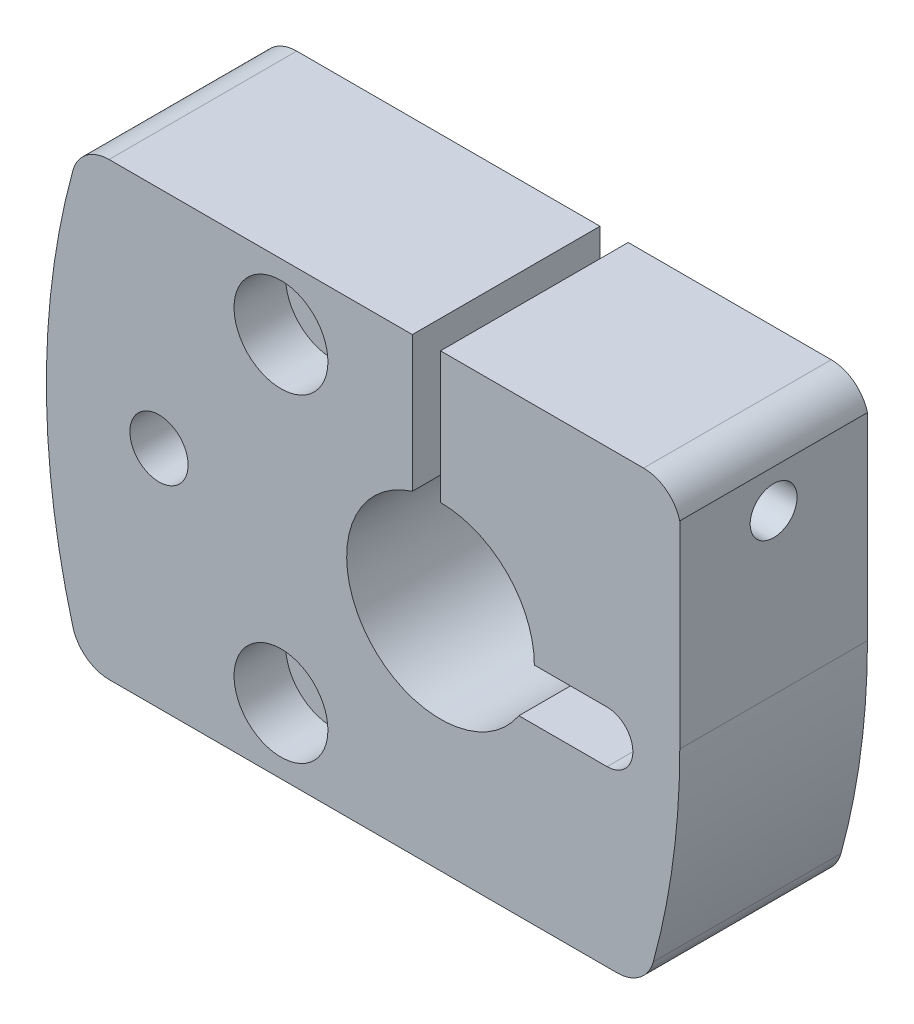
ISO-10303-21;
HEADER;
FILE_DESCRIPTION(('STEP AP214'),'2;1');
FILE_NAME('part.step','',(''),(''),'','','');
FILE_SCHEMA(('AUTOMOTIVE_DESIGN { 1 0 10303 214 1 1 1 1 }'));
ENDSEC;
DATA;
#1=APPLICATION_CONTEXT('core data for automotive mechanical design processes');
#2=APPLICATION_PROTOCOL_DEFINITION('international standard','automotive_design',2000,#1);
#3=PRODUCT_CONTEXT('',#1,'mechanical');
#4=PRODUCT('Part','Part','',(#3));
#5=PRODUCT_RELATED_PRODUCT_CATEGORY('part','',(#4));
#6=PRODUCT_DEFINITION_FORMATION('','',#4);
#7=PRODUCT_DEFINITION_CONTEXT('part definition',#1,'design');
#8=PRODUCT_DEFINITION('design','',#6,#7);
#9=PRODUCT_DEFINITION_SHAPE('','',#8);
#10=(LENGTH_UNIT() NAMED_UNIT(*) SI_UNIT(.MILLI.,.METRE.));
#11=(NAMED_UNIT(*) PLANE_ANGLE_UNIT() SI_UNIT($,.RADIAN.));
#12=(NAMED_UNIT(*) SI_UNIT($,.STERADIAN.) SOLID_ANGLE_UNIT());
#13=UNCERTAINTY_MEASURE_WITH_UNIT(LENGTH_MEASURE(1.E-05),#10,'distance_accuracy_value','');
#14=(GEOMETRIC_REPRESENTATION_CONTEXT(3) GLOBAL_UNCERTAINTY_ASSIGNED_CONTEXT((#13)) GLOBAL_UNIT_ASSIGNED_CONTEXT((#10,
#11,#12)) REPRESENTATION_CONTEXT('',''));
#15=CARTESIAN_POINT('',(0.,0.,0.));
#16=DIRECTION('',(0.,0.,1.));
#17=DIRECTION('',(1.,0.,0.));
#18=AXIS2_PLACEMENT_3D('',#15,#16,#17);
#19=CARTESIAN_POINT('',(-17.0000000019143,16.9999999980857,14.5));
#20=DIRECTION('',(0.,0.,-1.));
#21=DIRECTION('',(1.12604754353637E-10,-1.,0.));
#22=AXIS2_PLACEMENT_3D('',#19,#20,#21);
#23=CYLINDRICAL_SURFACE('',#22,2.75);
#24=CARTESIAN_POINT('',(-17.0000000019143,16.9999999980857,14.5));
#25=DIRECTION('',(0.,0.,-1.));
#26=DIRECTION('',(1.12604754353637E-10,-1.,0.));
#27=AXIS2_PLACEMENT_3D('',#24,#25,#26);
#28=CIRCLE('',#27,2.75);
#29=CARTESIAN_POINT('',(-17.0000000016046,14.2499999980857,14.5));
#30=VERTEX_POINT('',#29);
#31=EDGE_CURVE('E186',#30,#30,#28,.T.);
#32=ORIENTED_EDGE('',*,*,#31,.F.);
#33=EDGE_LOOP('',(#32));
#34=FACE_BOUND('',#33,.T.);
#35=CARTESIAN_POINT('',(-17.0000000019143,16.9999999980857,5.5));
#36=DIRECTION('',(0.,0.,-1.));
#37=DIRECTION('',(1.12604754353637E-10,-1.,0.));
#38=AXIS2_PLACEMENT_3D('',#35,#36,#37);
#39=CIRCLE('',#38,2.75);
#40=CARTESIAN_POINT('',(-17.0000000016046,14.2499999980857,5.5));
#41=VERTEX_POINT('',#40);
#42=EDGE_CURVE('E188',#41,#41,#39,.F.);
#43=ORIENTED_EDGE('',*,*,#42,.F.);
#44=EDGE_LOOP('',(#43));
#45=FACE_BOUND('',#44,.T.);
#46=ADVANCED_FACE('F14',(#34,#45),#23,.F.);
#47=CARTESIAN_POINT('',(-16.9999999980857,-17.0000000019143,14.5));
#48=DIRECTION('',(0.,0.,-1.));
#49=DIRECTION('',(1.12604754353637E-10,-1.,0.));
#50=AXIS2_PLACEMENT_3D('',#47,#48,#49);
#51=CYLINDRICAL_SURFACE('',#50,2.75);
#52=CARTESIAN_POINT('',(-16.9999999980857,-17.0000000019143,14.5));
#53=DIRECTION('',(0.,0.,-1.));
#54=DIRECTION('',(1.12604754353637E-10,-1.,0.));
#55=AXIS2_PLACEMENT_3D('',#52,#53,#54);
#56=CIRCLE('',#55,2.75);
#57=CARTESIAN_POINT('',(-16.999999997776,-19.7500000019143,14.5));
#58=VERTEX_POINT('',#57);
#59=EDGE_CURVE('E183',#58,#58,#56,.T.);
#60=ORIENTED_EDGE('',*,*,#59,.F.);
#61=EDGE_LOOP('',(#60));
#62=FACE_BOUND('',#61,.T.);
#63=CARTESIAN_POINT('',(-16.9999999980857,-17.0000000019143,5.5));
#64=DIRECTION('',(0.,0.,-1.));
#65=DIRECTION('',(1.12604754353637E-10,-1.,0.));
#66=AXIS2_PLACEMENT_3D('',#63,#64,#65);
#67=CIRCLE('',#66,2.75);
#68=CARTESIAN_POINT('',(-16.999999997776,-19.7500000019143,5.5));
#69=VERTEX_POINT('',#68);
#70=EDGE_CURVE('E18',#69,#69,#67,.F.);
#71=ORIENTED_EDGE('',*,*,#70,.F.);
#72=EDGE_LOOP('',(#71));
#73=FACE_BOUND('',#72,.T.);
#74=ADVANCED_FACE('F198',(#62,#73),#51,.F.);
#75=CARTESIAN_POINT('',(-9.50000000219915,19.5299999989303,7.461294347));
#76=DIRECTION('',(-1.,-1.12604754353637E-10,0.));
#77=DIRECTION('',(1.12604754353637E-10,-1.,0.));
#78=AXIS2_PLACEMENT_3D('',#75,#76,#77);
#79=PLANE('',#78);
#80=CARTESIAN_POINT('',(-9.50000000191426,16.9999999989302,10.));
#81=DIRECTION('',(1.,1.12604754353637E-10,0.));
#82=DIRECTION('',(0.,0.,-1.));
#83=AXIS2_PLACEMENT_3D('',#80,#81,#82);
#84=CIRCLE('',#83,2.5);
#85=CARTESIAN_POINT('',(-9.50000000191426,16.9999999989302,7.5));
#86=VERTEX_POINT('',#85);
#87=EDGE_CURVE('E180',#86,#86,#84,.T.);
#88=ORIENTED_EDGE('',*,*,#87,.T.);
#89=EDGE_LOOP('',(#88));
#90=FACE_BOUND('',#89,.T.);
#91=ADVANCED_FACE('F200',(#90),#79,.F.);
#92=CARTESIAN_POINT('',(-11.9225886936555,-11.9400000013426,5.5));
#93=DIRECTION('',(0.,0.,-1.));
#94=DIRECTION('',(1.12604754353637E-10,-1.,0.));
#95=AXIS2_PLACEMENT_3D('',#92,#93,#94);
#96=PLANE('',#95);
#97=ORIENTED_EDGE('',*,*,#70,.T.);
#98=EDGE_LOOP('',(#97));
#99=FACE_BOUND('',#98,.T.);
#100=CARTESIAN_POINT('',(-16.9999999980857,-17.0000000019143,5.5));
#101=DIRECTION('',(0.,0.,-1.));
#102=DIRECTION('',(1.12604754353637E-10,-1.,0.));
#103=AXIS2_PLACEMENT_3D('',#100,#101,#102);
#104=CIRCLE('',#103,5.);
#105=CARTESIAN_POINT('',(-16.9999999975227,-22.0000000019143,5.5));
#106=VERTEX_POINT('',#105);
#107=EDGE_CURVE('E177',#106,#106,#104,.T.);
#108=ORIENTED_EDGE('',*,*,#107,.T.);
#109=EDGE_LOOP('',(#108));
#110=FACE_BOUND('',#109,.T.);
#111=ADVANCED_FACE('F195',(#99,#110),#96,.T.);
#112=CARTESIAN_POINT('',(-11.922588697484,22.0599999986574,5.5));
#113=DIRECTION('',(0.,0.,-1.));
#114=DIRECTION('',(1.12604754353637E-10,-1.,0.));
#115=AXIS2_PLACEMENT_3D('',#112,#113,#114);
#116=PLANE('',#115);
#117=ORIENTED_EDGE('',*,*,#42,.T.);
#118=EDGE_LOOP('',(#117));
#119=FACE_BOUND('',#118,.T.);
#120=CARTESIAN_POINT('',(-17.0000000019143,16.9999999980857,5.5));
#121=DIRECTION('',(0.,0.,-1.));
#122=DIRECTION('',(1.12604754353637E-10,-1.,0.));
#123=AXIS2_PLACEMENT_3D('',#120,#121,#122);
#124=CIRCLE('',#123,5.);
#125=CARTESIAN_POINT('',(-17.0000000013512,11.9999999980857,5.5));
#126=VERTEX_POINT('',#125);
#127=EDGE_CURVE('E174',#126,#126,#124,.T.);
#128=ORIENTED_EDGE('',*,*,#127,.T.);
#129=EDGE_LOOP('',(#128));
#130=FACE_BOUND('',#129,.T.);
#131=ADVANCED_FACE('F230',(#119,#130),#116,.T.);
#132=CARTESIAN_POINT('',(-1.91425000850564E-09,17.,10.));
#133=DIRECTION('',(1.,1.12604754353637E-10,0.));
#134=DIRECTION('',(0.,0.,-1.));
#135=AXIS2_PLACEMENT_3D('',#132,#133,#134);
#136=CYLINDRICAL_SURFACE('',#135,2.5);
#137=CARTESIAN_POINT('',(25.4999999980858,17.0000000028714,10.));
#138=DIRECTION('',(1.,1.12604754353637E-10,0.));
#139=DIRECTION('',(0.,0.,-1.));
#140=AXIS2_PLACEMENT_3D('',#137,#138,#139);
#141=CIRCLE('',#140,2.5);
#142=CARTESIAN_POINT('',(25.4999999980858,17.0000000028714,7.5));
#143=VERTEX_POINT('',#142);
#144=EDGE_CURVE('E166',#143,#143,#141,.T.);
#145=ORIENTED_EDGE('',*,*,#144,.T.);
#146=EDGE_LOOP('',(#145));
#147=FACE_BOUND('',#146,.T.);
#148=CARTESIAN_POINT('',(-1.91425000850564E-09,17.,10.));
#149=DIRECTION('',(1.,1.12604754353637E-10,0.));
#150=DIRECTION('',(0.,0.,-1.));
#151=AXIS2_PLACEMENT_3D('',#148,#149,#150);
#152=CIRCLE('',#151,2.5);
#153=CARTESIAN_POINT('',(-1.91425000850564E-09,17.,7.5));
#154=VERTEX_POINT('',#153);
#155=EDGE_CURVE('E171',#154,#154,#152,.F.);
#156=ORIENTED_EDGE('',*,*,#155,.T.);
#157=EDGE_LOOP('',(#156));
#158=FACE_BOUND('',#157,.T.);
#159=ADVANCED_FACE('F233',(#147,#158),#136,.F.);
#160=CARTESIAN_POINT('',(-11.9225886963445,11.9399999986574,14.5));
#161=DIRECTION('',(0.,0.,1.));
#162=DIRECTION('',(-1.12604754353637E-10,1.,0.));
#163=AXIS2_PLACEMENT_3D('',#160,#161,#162);
#164=PLANE('',#163);
#165=ORIENTED_EDGE('',*,*,#31,.T.);
#166=EDGE_LOOP('',(#165));
#167=FACE_BOUND('',#166,.T.);
#168=CARTESIAN_POINT('',(-17.0000000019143,16.9999999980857,14.5));
#169=DIRECTION('',(0.,0.,1.));
#170=DIRECTION('',(-1.12604754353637E-10,1.,0.));
#171=AXIS2_PLACEMENT_3D('',#168,#169,#170);
#172=CIRCLE('',#171,5.);
#173=CARTESIAN_POINT('',(-17.0000000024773,21.9999999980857,14.5));
#174=VERTEX_POINT('',#173);
#175=EDGE_CURVE('E162',#174,#174,#172,.T.);
#176=ORIENTED_EDGE('',*,*,#175,.T.);
#177=EDGE_LOOP('',(#176));
#178=FACE_BOUND('',#177,.T.);
#179=ADVANCED_FACE('F234',(#167,#178),#164,.T.);
#180=CARTESIAN_POINT('',(-11.9225886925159,-22.0600000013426,14.5));
#181=DIRECTION('',(0.,0.,1.));
#182=DIRECTION('',(-1.12604754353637E-10,1.,0.));
#183=AXIS2_PLACEMENT_3D('',#180,#181,#182);
#184=PLANE('',#183);
#185=ORIENTED_EDGE('',*,*,#59,.T.);
#186=EDGE_LOOP('',(#185));
#187=FACE_BOUND('',#186,.T.);
#188=CARTESIAN_POINT('',(-16.9999999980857,-17.0000000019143,14.5));
#189=DIRECTION('',(0.,0.,1.));
#190=DIRECTION('',(-1.12604754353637E-10,1.,0.));
#191=AXIS2_PLACEMENT_3D('',#188,#189,#190);
#192=CIRCLE('',#191,5.);
#193=CARTESIAN_POINT('',(-16.9999999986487,-12.0000000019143,14.5));
#194=VERTEX_POINT('',#193);
#195=EDGE_CURVE('E159',#194,#194,#192,.T.);
#196=ORIENTED_EDGE('',*,*,#195,.T.);
#197=EDGE_LOOP('',(#196));
#198=FACE_BOUND('',#197,.T.);
#199=ADVANCED_FACE('F237',(#187,#198),#184,.T.);
#200=CARTESIAN_POINT('',(-9.50000000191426,16.9999999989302,10.));
#201=DIRECTION('',(1.,1.12604754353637E-10,0.));
#202=DIRECTION('',(0.,0.,-1.));
#203=AXIS2_PLACEMENT_3D('',#200,#201,#202);
#204=CYLINDRICAL_SURFACE('',#203,2.5);
#205=ORIENTED_EDGE('',*,*,#87,.F.);
#206=EDGE_LOOP('',(#205));
#207=FACE_BOUND('',#206,.T.);
#208=CARTESIAN_POINT('',(-3.00000000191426,16.9999999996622,10.));
#209=DIRECTION('',(1.,1.12604754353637E-10,0.));
#210=DIRECTION('',(0.,0.,-1.));
#211=AXIS2_PLACEMENT_3D('',#208,#209,#210);
#212=CIRCLE('',#211,2.5);
#213=CARTESIAN_POINT('',(-3.00000000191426,16.9999999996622,7.5));
#214=VERTEX_POINT('',#213);
#215=EDGE_CURVE('E151',#214,#214,#212,.T.);
#216=ORIENTED_EDGE('',*,*,#215,.T.);
#217=EDGE_LOOP('',(#216));
#218=FACE_BOUND('',#217,.T.);
#219=ADVANCED_FACE('F241',(#207,#218),#204,.F.);
#220=CARTESIAN_POINT('',(-16.9999999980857,-17.0000000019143,5.5));
#221=DIRECTION('',(0.,0.,-1.));
#222=DIRECTION('',(1.12604754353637E-10,-1.,0.));
#223=AXIS2_PLACEMENT_3D('',#220,#221,#222);
#224=CYLINDRICAL_SURFACE('',#223,5.);
#225=ORIENTED_EDGE('',*,*,#107,.F.);
#226=EDGE_LOOP('',(#225));
#227=FACE_BOUND('',#226,.T.);
#228=CARTESIAN_POINT('',(-16.9999999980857,-17.0000000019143,0.));
#229=DIRECTION('',(0.,0.,-1.));
#230=DIRECTION('',(1.12604754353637E-10,-1.,0.));
#231=AXIS2_PLACEMENT_3D('',#228,#229,#230);
#232=CIRCLE('',#231,5.);
#233=CARTESIAN_POINT('',(-16.9999999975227,-22.0000000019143,0.));
#234=VERTEX_POINT('',#233);
#235=EDGE_CURVE('E295',#234,#234,#232,.T.);
#236=ORIENTED_EDGE('',*,*,#235,.T.);
#237=EDGE_LOOP('',(#236));
#238=FACE_BOUND('',#237,.T.);
#239=ADVANCED_FACE('F661',(#227,#238),#224,.F.);
#240=CARTESIAN_POINT('',(-17.0000000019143,16.9999999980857,5.5));
#241=DIRECTION('',(0.,0.,-1.));
#242=DIRECTION('',(1.12604754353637E-10,-1.,0.));
#243=AXIS2_PLACEMENT_3D('',#240,#241,#242);
#244=CYLINDRICAL_SURFACE('',#243,5.);
#245=ORIENTED_EDGE('',*,*,#127,.F.);
#246=EDGE_LOOP('',(#245));
#247=FACE_BOUND('',#246,.T.);
#248=CARTESIAN_POINT('',(-17.0000000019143,16.9999999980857,0.));
#249=DIRECTION('',(0.,0.,-1.));
#250=DIRECTION('',(1.12604754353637E-10,-1.,0.));
#251=AXIS2_PLACEMENT_3D('',#248,#249,#250);
#252=CIRCLE('',#251,5.);
#253=CARTESIAN_POINT('',(-17.0000000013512,11.9999999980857,0.));
#254=VERTEX_POINT('',#253);
#255=EDGE_CURVE('E292',#254,#254,#252,.T.);
#256=ORIENTED_EDGE('',*,*,#255,.T.);
#257=EDGE_LOOP('',(#256));
#258=FACE_BOUND('',#257,.T.);
#259=ADVANCED_FACE('F246',(#247,#258),#244,.F.);
#260=CARTESIAN_POINT('',(-1.12604717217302E-09,10.,20.));
#261=DIRECTION('',(1.,1.12604754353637E-10,0.));
#262=DIRECTION('',(0.,0.,-1.));
#263=AXIS2_PLACEMENT_3D('',#260,#261,#262);
#264=PLANE('',#263);
#265=ORIENTED_EDGE('',*,*,#155,.F.);
#266=EDGE_LOOP('',(#265));
#267=FACE_BOUND('',#266,.T.);
#268=DIRECTION('',(0.,0.,1.));
#269=VECTOR('',#268,1.);
#270=CARTESIAN_POINT('',(2.97600138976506E-09,10.,10.));
#271=LINE('',#270,#269);
#272=CARTESIAN_POINT('',(7.71755229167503E-09,10.,0.));
#273=VERTEX_POINT('',#272);
#274=CARTESIAN_POINT('',(7.71755229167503E-09,10.,20.));
#275=VERTEX_POINT('',#274);
#276=EDGE_CURVE('E125',#273,#275,#271,.T.);
#277=ORIENTED_EDGE('',*,*,#276,.T.);
#278=DIRECTION('',(1.12604754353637E-10,-1.,0.));
#279=VECTOR('',#278,1.);
#280=CARTESIAN_POINT('',(1.3585150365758E-08,0.,20.));
#281=LINE('',#280,#279);
#282=CARTESIAN_POINT('',(6.35425045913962E-09,24.,20.));
#283=VERTEX_POINT('',#282);
#284=EDGE_CURVE('E371',#283,#275,#281,.T.);
#285=ORIENTED_EDGE('',*,*,#284,.F.);
#286=DIRECTION('',(0.,0.,-1.));
#287=VECTOR('',#286,1.);
#288=CARTESIAN_POINT('',(-2.70249794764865E-09,24.,10.));
#289=LINE('',#288,#287);
#290=CARTESIAN_POINT('',(6.35425045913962E-09,24.,0.));
#291=VERTEX_POINT('',#290);
#292=EDGE_CURVE('E165',#283,#291,#289,.T.);
#293=ORIENTED_EDGE('',*,*,#292,.T.);
#294=DIRECTION('',(1.12604754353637E-10,-1.,0.));
#295=VECTOR('',#294,1.);
#296=CARTESIAN_POINT('',(1.3585150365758E-08,0.,0.));
#297=LINE('',#296,#295);
#298=EDGE_CURVE('E297',#291,#273,#297,.T.);
#299=ORIENTED_EDGE('',*,*,#298,.T.);
#300=EDGE_LOOP('',(#277,#285,#293,#299));
#301=FACE_BOUND('',#300,.T.);
#302=ADVANCED_FACE('F243',(#267,#301),#264,.F.);
#303=CARTESIAN_POINT('',(0.,0.,20.));
#304=DIRECTION('',(0.,0.,-1.));
#305=DIRECTION('',(1.12604754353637E-10,-1.,0.));
#306=AXIS2_PLACEMENT_3D('',#303,#304,#305);
#307=CYLINDRICAL_SURFACE('',#306,10.);
#308=DIRECTION('',(0.,0.,1.));
#309=VECTOR('',#308,1.);
#310=CARTESIAN_POINT('',(10.,1.12605064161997E-09,10.));
#311=LINE('',#310,#309);
#312=CARTESIAN_POINT('',(10.,1.12605064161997E-09,0.));
#313=VERTEX_POINT('',#312);
#314=CARTESIAN_POINT('',(10.,1.12605064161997E-09,20.));
#315=VERTEX_POINT('',#314);
#316=EDGE_CURVE('E132',#313,#315,#311,.T.);
#317=ORIENTED_EDGE('',*,*,#316,.T.);
#318=CARTESIAN_POINT('',(0.,0.,20.));
#319=DIRECTION('',(0.,0.,-1.));
#320=DIRECTION('',(1.12604754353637E-10,-1.,0.));
#321=AXIS2_PLACEMENT_3D('',#318,#319,#320);
#322=CIRCLE('',#321,10.);
#323=EDGE_CURVE('E370',#275,#315,#322,.T.);
#324=ORIENTED_EDGE('',*,*,#323,.F.);
#325=ORIENTED_EDGE('',*,*,#276,.F.);
#326=CARTESIAN_POINT('',(0.,0.,0.));
#327=DIRECTION('',(0.,0.,-1.));
#328=DIRECTION('',(1.12604754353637E-10,-1.,0.));
#329=AXIS2_PLACEMENT_3D('',#326,#327,#328);
#330=CIRCLE('',#329,10.);
#331=EDGE_CURVE('E144',#273,#313,#330,.T.);
#332=ORIENTED_EDGE('',*,*,#331,.T.);
#333=EDGE_LOOP('',(#317,#324,#325,#332));
#334=FACE_BOUND('',#333,.T.);
#335=ADVANCED_FACE('F150',(#334),#307,.F.);
#336=CARTESIAN_POINT('',(17.75,1.99869981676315E-09,20.));
#337=DIRECTION('',(-1.12604754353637E-10,1.,0.));
#338=DIRECTION('',(0.,0.,-1.));
#339=AXIS2_PLACEMENT_3D('',#336,#337,#338);
#340=PLANE('',#339);
#341=DIRECTION('',(0.,0.,1.));
#342=VECTOR('',#341,1.);
#343=CARTESIAN_POINT('',(17.750000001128,1.99869981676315E-09,10.));
#344=LINE('',#343,#342);
#345=CARTESIAN_POINT('',(17.750000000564,1.99869981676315E-09,0.));
#346=VERTEX_POINT('',#345);
#347=CARTESIAN_POINT('',(17.750000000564,1.99869981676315E-09,20.));
#348=VERTEX_POINT('',#347);
#349=EDGE_CURVE('E138',#346,#348,#344,.T.);
#350=ORIENTED_EDGE('',*,*,#349,.T.);
#351=DIRECTION('',(1.,1.12604754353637E-10,0.));
#352=VECTOR('',#351,1.);
#353=CARTESIAN_POINT('',(-8.80382733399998,-9.9134936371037E-10,20.));
#354=LINE('',#353,#352);
#355=EDGE_CURVE('E137',#315,#348,#354,.T.);
#356=ORIENTED_EDGE('',*,*,#355,.F.);
#357=ORIENTED_EDGE('',*,*,#316,.F.);
#358=DIRECTION('',(1.,1.12604754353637E-10,0.));
#359=VECTOR('',#358,1.);
#360=CARTESIAN_POINT('',(-8.80382733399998,-9.9134936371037E-10,0.));
#361=LINE('',#360,#359);
#362=EDGE_CURVE('E136',#313,#346,#361,.T.);
#363=ORIENTED_EDGE('',*,*,#362,.T.);
#364=EDGE_LOOP('',(#350,#356,#357,#363));
#365=FACE_BOUND('',#364,.T.);
#366=ADVANCED_FACE('F135',(#365),#340,.F.);
#367=CARTESIAN_POINT('',(17.7500000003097,-2.74999999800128,20.));
#368=DIRECTION('',(0.,0.,-1.));
#369=DIRECTION('',(1.12604754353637E-10,-1.,0.));
#370=AXIS2_PLACEMENT_3D('',#367,#368,#369);
#371=CYLINDRICAL_SURFACE('',#370,2.75);
#372=DIRECTION('',(0.,0.,1.));
#373=VECTOR('',#372,1.);
#374=CARTESIAN_POINT('',(17.7500000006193,-5.49999999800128,10.));
#375=LINE('',#374,#373);
#376=CARTESIAN_POINT('',(17.7500000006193,-5.49999999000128,0.));
#377=VERTEX_POINT('',#376);
#378=CARTESIAN_POINT('',(17.7500000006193,-5.49999999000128,20.));
#379=VERTEX_POINT('',#378);
#380=EDGE_CURVE('E403',#377,#379,#375,.T.);
#381=ORIENTED_EDGE('',*,*,#380,.T.);
#382=CARTESIAN_POINT('',(17.7500000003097,-2.74999999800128,20.));
#383=DIRECTION('',(0.,0.,-1.));
#384=DIRECTION('',(1.12604754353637E-10,-1.,0.));
#385=AXIS2_PLACEMENT_3D('',#382,#383,#384);
#386=CIRCLE('',#385,2.75);
#387=EDGE_CURVE('E368',#348,#379,#386,.T.);
#388=ORIENTED_EDGE('',*,*,#387,.F.);
#389=ORIENTED_EDGE('',*,*,#349,.F.);
#390=CARTESIAN_POINT('',(17.7500000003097,-2.74999999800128,0.));
#391=DIRECTION('',(0.,0.,-1.));
#392=DIRECTION('',(1.12604754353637E-10,-1.,0.));
#393=AXIS2_PLACEMENT_3D('',#390,#391,#392);
#394=CIRCLE('',#393,2.75);
#395=EDGE_CURVE('E148',#346,#377,#394,.T.);
#396=ORIENTED_EDGE('',*,*,#395,.T.);
#397=EDGE_LOOP('',(#381,#388,#389,#396));
#398=FACE_BOUND('',#397,.T.);
#399=ADVANCED_FACE('F250',(#398),#371,.F.);
#400=CARTESIAN_POINT('',(17.7500000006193,-5.49999999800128,0.));
#401=DIRECTION('',(1.12604754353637E-10,-1.,0.));
#402=DIRECTION('',(0.,0.,1.));
#403=AXIS2_PLACEMENT_3D('',#400,#401,#402);
#404=PLANE('',#403);
#405=DIRECTION('',(0.,0.,1.));
#406=VECTOR('',#405,1.);
#407=CARTESIAN_POINT('',(8.35164654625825,-5.499999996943,10.));
#408=LINE('',#407,#406);
#409=CARTESIAN_POINT('',(8.35164655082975,-5.49999999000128,0.));
#410=VERTEX_POINT('',#409);
#411=CARTESIAN_POINT('',(8.35164655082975,-5.49999999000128,20.));
#412=VERTEX_POINT('',#411);
#413=EDGE_CURVE('E373',#410,#412,#408,.T.);
#414=ORIENTED_EDGE('',*,*,#413,.T.);
#415=DIRECTION('',(-1.,-1.12604754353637E-10,0.));
#416=VECTOR('',#415,1.);
#417=CARTESIAN_POINT('',(-8.80382733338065,-5.49999998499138,20.));
#418=LINE('',#417,#416);
#419=EDGE_CURVE('E363',#379,#412,#418,.T.);
#420=ORIENTED_EDGE('',*,*,#419,.F.);
#421=ORIENTED_EDGE('',*,*,#380,.F.);
#422=DIRECTION('',(-1.,-1.12604754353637E-10,0.));
#423=VECTOR('',#422,1.);
#424=CARTESIAN_POINT('',(-8.80382733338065,-5.49999998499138,0.));
#425=LINE('',#424,#423);
#426=EDGE_CURVE('E330',#377,#410,#425,.T.);
#427=ORIENTED_EDGE('',*,*,#426,.T.);
#428=EDGE_LOOP('',(#414,#420,#421,#427));
#429=FACE_BOUND('',#428,.T.);
#430=ADVANCED_FACE('F251',(#429),#404,.F.);
#431=CARTESIAN_POINT('',(-35.3212111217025,23.9999999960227,0.));
#432=DIRECTION('',(1.12604754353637E-10,-1.,0.));
#433=DIRECTION('',(1.,1.12604754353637E-10,0.));
#434=AXIS2_PLACEMENT_3D('',#431,#432,#433);
#435=PLANE('',#434);
#436=DIRECTION('',(0.,0.,-1.));
#437=VECTOR('',#436,1.);
#438=CARTESIAN_POINT('',(-35.3212111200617,23.9999999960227,10.));
#439=LINE('',#438,#437);
#440=CARTESIAN_POINT('',(-35.3212111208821,23.9999999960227,20.));
#441=VERTEX_POINT('',#440);
#442=CARTESIAN_POINT('',(-35.3212111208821,23.9999999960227,0.));
#443=VERTEX_POINT('',#442);
#444=EDGE_CURVE('E401',#441,#443,#439,.T.);
#445=ORIENTED_EDGE('',*,*,#444,.F.);
#446=DIRECTION('',(-1.,-1.12604754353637E-10,0.));
#447=VECTOR('',#446,1.);
#448=CARTESIAN_POINT('',(-8.80382733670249,23.9999999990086,20.));
#449=LINE('',#448,#447);
#450=CARTESIAN_POINT('',(-2.99999998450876,23.9999999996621,20.));
#451=VERTEX_POINT('',#450);
#452=EDGE_CURVE('E355',#451,#441,#449,.T.);
#453=ORIENTED_EDGE('',*,*,#452,.F.);
#454=DIRECTION('',(0.,0.,-1.));
#455=VECTOR('',#454,1.);
#456=CARTESIAN_POINT('',(-3.0000000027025,23.9999999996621,10.));
#457=LINE('',#456,#455);
#458=CARTESIAN_POINT('',(-2.99999998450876,23.9999999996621,0.));
#459=VERTEX_POINT('',#458);
#460=EDGE_CURVE('E154',#451,#459,#457,.T.);
#461=ORIENTED_EDGE('',*,*,#460,.T.);
#462=DIRECTION('',(-1.,-1.12604754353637E-10,0.));
#463=VECTOR('',#462,1.);
#464=CARTESIAN_POINT('',(-8.80382733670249,23.9999999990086,0.));
#465=LINE('',#464,#463);
#466=EDGE_CURVE('E322',#459,#443,#465,.T.);
#467=ORIENTED_EDGE('',*,*,#466,.T.);
#468=EDGE_LOOP('',(#445,#453,#461,#467));
#469=FACE_BOUND('',#468,.T.);
#470=ADVANCED_FACE('F254',(#469),#435,.F.);
#471=CARTESIAN_POINT('',(-35.321211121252,19.9999999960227,20.));
#472=DIRECTION('',(0.,0.,-1.));
#473=DIRECTION('',(1.12604754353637E-10,-1.,0.));
#474=AXIS2_PLACEMENT_3D('',#471,#472,#473);
#475=CYLINDRICAL_SURFACE('',#474,4.);
#476=CARTESIAN_POINT('',(-35.321211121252,19.9999999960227,20.));
#477=DIRECTION('',(0.,0.,-1.));
#478=DIRECTION('',(1.12604754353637E-10,-1.,0.));
#479=AXIS2_PLACEMENT_3D('',#476,#477,#478);
#480=CIRCLE('',#479,4.);
#481=CARTESIAN_POINT('',(-39.1802222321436,21.0526315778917,20.));
#482=VERTEX_POINT('',#481);
#483=EDGE_CURVE('E357',#441,#482,#480,.F.);
#484=ORIENTED_EDGE('',*,*,#483,.F.);
#485=ORIENTED_EDGE('',*,*,#444,.T.);
#486=CARTESIAN_POINT('',(-35.321211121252,19.9999999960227,0.));
#487=DIRECTION('',(0.,0.,-1.));
#488=DIRECTION('',(1.12604754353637E-10,-1.,0.));
#489=AXIS2_PLACEMENT_3D('',#486,#487,#488);
#490=CIRCLE('',#489,4.);
#491=CARTESIAN_POINT('',(-39.1802222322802,21.0526315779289,0.));
#492=VERTEX_POINT('',#491);
#493=EDGE_CURVE('E320',#443,#492,#490,.F.);
#494=ORIENTED_EDGE('',*,*,#493,.T.);
#495=DIRECTION('',(0.,0.,-1.));
#496=VECTOR('',#495,1.);
#497=CARTESIAN_POINT('',(-39.1802222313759,21.0526315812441,10.));
#498=LINE('',#497,#496);
#499=EDGE_CURVE('E399',#482,#492,#498,.T.);
#500=ORIENTED_EDGE('',*,*,#499,.F.);
#501=EDGE_LOOP('',(#484,#485,#494,#500));
#502=FACE_BOUND('',#501,.T.);
#503=ADVANCED_FACE('F258',(#502),#475,.T.);
#504=CARTESIAN_POINT('',(38.,4.27895219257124E-09,20.));
#505=DIRECTION('',(0.,0.,-1.));
#506=DIRECTION('',(1.12604754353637E-10,-1.,0.));
#507=AXIS2_PLACEMENT_3D('',#504,#505,#506);
#508=CYLINDRICAL_SURFACE('',#507,80.);
#509=CARTESIAN_POINT('',(38.,4.27895219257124E-09,20.));
#510=DIRECTION('',(0.,0.,-1.));
#511=DIRECTION('',(1.12604754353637E-10,-1.,0.));
#512=AXIS2_PLACEMENT_3D('',#509,#510,#511);
#513=CIRCLE('',#512,80.);
#514=CARTESIAN_POINT('',(-39.1802222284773,-21.0526315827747,20.));
#515=VERTEX_POINT('',#514);
#516=EDGE_CURVE('E425',#482,#515,#513,.F.);
#517=ORIENTED_EDGE('',*,*,#516,.F.);
#518=ORIENTED_EDGE('',*,*,#499,.T.);
#519=CARTESIAN_POINT('',(38.,4.27895219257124E-09,0.));
#520=DIRECTION('',(0.,0.,-1.));
#521=DIRECTION('',(1.12604754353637E-10,-1.,0.));
#522=AXIS2_PLACEMENT_3D('',#519,#520,#521);
#523=CIRCLE('',#522,80.);
#524=CARTESIAN_POINT('',(-39.1802222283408,-21.0526315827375,0.));
#525=VERTEX_POINT('',#524);
#526=EDGE_CURVE('E318',#492,#525,#523,.F.);
#527=ORIENTED_EDGE('',*,*,#526,.T.);
#528=DIRECTION('',(0.,0.,-1.));
#529=VECTOR('',#528,1.);
#530=CARTESIAN_POINT('',(-39.1802222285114,-21.0526315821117,10.));
#531=LINE('',#530,#529);
#532=EDGE_CURVE('E397',#515,#525,#531,.T.);
#533=ORIENTED_EDGE('',*,*,#532,.F.);
#534=EDGE_LOOP('',(#517,#518,#527,#533));
#535=FACE_BOUND('',#534,.T.);
#536=ADVANCED_FACE('F481',(#535),#508,.T.);
#537=CARTESIAN_POINT('',(-35.3212111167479,-20.0000000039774,20.));
#538=DIRECTION('',(0.,0.,-1.));
#539=DIRECTION('',(1.12604754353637E-10,-1.,0.));
#540=AXIS2_PLACEMENT_3D('',#537,#538,#539);
#541=CYLINDRICAL_SURFACE('',#540,4.);
#542=CARTESIAN_POINT('',(-35.3212111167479,-20.0000000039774,20.));
#543=DIRECTION('',(0.,0.,-1.));
#544=DIRECTION('',(1.12604754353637E-10,-1.,0.));
#545=AXIS2_PLACEMENT_3D('',#542,#543,#544);
#546=CIRCLE('',#545,4.);
#547=CARTESIAN_POINT('',(-35.3212111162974,-24.0000000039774,20.));
#548=VERTEX_POINT('',#547);
#549=EDGE_CURVE('E354',#515,#548,#546,.F.);
#550=ORIENTED_EDGE('',*,*,#549,.F.);
#551=ORIENTED_EDGE('',*,*,#532,.T.);
#552=CARTESIAN_POINT('',(-35.3212111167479,-20.0000000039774,0.));
#553=DIRECTION('',(0.,0.,-1.));
#554=DIRECTION('',(1.12604754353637E-10,-1.,0.));
#555=AXIS2_PLACEMENT_3D('',#552,#553,#554);
#556=CIRCLE('',#555,4.);
#557=CARTESIAN_POINT('',(-35.3212111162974,-24.0000000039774,0.));
#558=VERTEX_POINT('',#557);
#559=EDGE_CURVE('E315',#525,#558,#556,.F.);
#560=ORIENTED_EDGE('',*,*,#559,.T.);
#561=DIRECTION('',(0.,0.,1.));
#562=VECTOR('',#561,1.);
#563=CARTESIAN_POINT('',(-35.3212111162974,-24.0000000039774,10.));
#564=LINE('',#563,#562);
#565=EDGE_CURVE('E394',#558,#548,#564,.T.);
#566=ORIENTED_EDGE('',*,*,#565,.T.);
#567=EDGE_LOOP('',(#550,#551,#560,#566));
#568=FACE_BOUND('',#567,.T.);
#569=ADVANCED_FACE('F264',(#568),#541,.T.);
#570=CARTESIAN_POINT('',(18.8212111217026,-23.9999999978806,20.));
#571=DIRECTION('',(-1.12604754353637E-10,1.,0.));
#572=DIRECTION('',(0.,0.,-1.));
#573=AXIS2_PLACEMENT_3D('',#570,#571,#572);
#574=PLANE('',#573);
#575=DIRECTION('',(0.,0.,-1.));
#576=VECTOR('',#575,1.);
#577=CARTESIAN_POINT('',(18.8212111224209,-23.9999999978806,10.));
#578=LINE('',#577,#576);
#579=CARTESIAN_POINT('',(18.8212111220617,-23.9999999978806,20.));
#580=VERTEX_POINT('',#579);
#581=CARTESIAN_POINT('',(18.8212111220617,-23.9999999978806,0.));
#582=VERTEX_POINT('',#581);
#583=EDGE_CURVE('E392',#580,#582,#578,.T.);
#584=ORIENTED_EDGE('',*,*,#583,.F.);
#585=DIRECTION('',(1.,1.12604754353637E-10,0.));
#586=VECTOR('',#585,1.);
#587=CARTESIAN_POINT('',(-8.80382733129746,-24.0000000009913,20.));
#588=LINE('',#587,#586);
#589=EDGE_CURVE('E351',#548,#580,#588,.T.);
#590=ORIENTED_EDGE('',*,*,#589,.F.);
#591=ORIENTED_EDGE('',*,*,#565,.F.);
#592=DIRECTION('',(1.,1.12604754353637E-10,0.));
#593=VECTOR('',#592,1.);
#594=CARTESIAN_POINT('',(-8.80382733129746,-24.0000000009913,0.));
#595=LINE('',#594,#593);
#596=EDGE_CURVE('E314',#558,#582,#595,.T.);
#597=ORIENTED_EDGE('',*,*,#596,.T.);
#598=EDGE_LOOP('',(#584,#590,#591,#597));
#599=FACE_BOUND('',#598,.T.);
#600=ADVANCED_FACE('F260',(#599),#574,.F.);
#601=CARTESIAN_POINT('',(18.8212111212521,-19.9999999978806,20.));
#602=DIRECTION('',(0.,0.,-1.));
#603=DIRECTION('',(1.12604754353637E-10,-1.,0.));
#604=AXIS2_PLACEMENT_3D('',#601,#602,#603);
#605=CYLINDRICAL_SURFACE('',#604,4.);
#606=CARTESIAN_POINT('',(18.8212111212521,-19.9999999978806,20.));
#607=DIRECTION('',(0.,0.,-1.));
#608=DIRECTION('',(1.12604754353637E-10,-1.,0.));
#609=AXIS2_PLACEMENT_3D('',#606,#607,#608);
#610=CIRCLE('',#609,4.);
#611=CARTESIAN_POINT('',(22.6802222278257,-21.0526315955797,20.));
#612=VERTEX_POINT('',#611);
#613=EDGE_CURVE('E353',#580,#612,#610,.F.);
#614=ORIENTED_EDGE('',*,*,#613,.F.);
#615=ORIENTED_EDGE('',*,*,#583,.T.);
#616=CARTESIAN_POINT('',(18.8212111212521,-19.9999999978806,0.));
#617=DIRECTION('',(0.,0.,-1.));
#618=DIRECTION('',(1.12604754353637E-10,-1.,0.));
#619=AXIS2_PLACEMENT_3D('',#616,#617,#618);
#620=CIRCLE('',#619,4.);
#621=CARTESIAN_POINT('',(22.6802222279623,-21.0526315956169,0.));
#622=VERTEX_POINT('',#621);
#623=EDGE_CURVE('E311',#582,#622,#620,.F.);
#624=ORIENTED_EDGE('',*,*,#623,.T.);
#625=DIRECTION('',(0.,0.,-1.));
#626=VECTOR('',#625,1.);
#627=CARTESIAN_POINT('',(22.68022222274,-21.0526316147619,10.));
#628=LINE('',#627,#626);
#629=EDGE_CURVE('E390',#612,#622,#628,.T.);
#630=ORIENTED_EDGE('',*,*,#629,.F.);
#631=EDGE_LOOP('',(#614,#615,#624,#630));
#632=FACE_BOUND('',#631,.T.);
#633=ADVANCED_FACE('F263',(#632),#605,.T.);
#634=CARTESIAN_POINT('',(-54.5,-6.13700062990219E-09,20.));
#635=DIRECTION('',(0.,0.,-1.));
#636=DIRECTION('',(1.12604754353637E-10,-1.,0.));
#637=AXIS2_PLACEMENT_3D('',#634,#635,#636);
#638=CYLINDRICAL_SURFACE('',#637,80.);
#639=CARTESIAN_POINT('',(-54.5,-6.13700062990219E-09,20.));
#640=DIRECTION('',(0.,0.,-1.));
#641=DIRECTION('',(1.12604754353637E-10,-1.,0.));
#642=AXIS2_PLACEMENT_3D('',#639,#640,#641);
#643=CIRCLE('',#642,80.);
#644=CARTESIAN_POINT('',(25.5,2.87140103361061E-09,20.));
#645=VERTEX_POINT('',#644);
#646=EDGE_CURVE('E350',#612,#645,#643,.F.);
#647=ORIENTED_EDGE('',*,*,#646,.F.);
#648=ORIENTED_EDGE('',*,*,#629,.T.);
#649=CARTESIAN_POINT('',(-54.5,-6.13700062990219E-09,0.));
#650=DIRECTION('',(0.,0.,-1.));
#651=DIRECTION('',(1.12604754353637E-10,-1.,0.));
#652=AXIS2_PLACEMENT_3D('',#649,#650,#651);
#653=CIRCLE('',#652,80.);
#654=CARTESIAN_POINT('',(25.5,2.87140103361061E-09,0.));
#655=VERTEX_POINT('',#654);
#656=EDGE_CURVE('E308',#622,#655,#653,.F.);
#657=ORIENTED_EDGE('',*,*,#656,.T.);
#658=DIRECTION('',(0.,0.,1.));
#659=VECTOR('',#658,1.);
#660=CARTESIAN_POINT('',(25.5,2.87140103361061E-09,10.));
#661=LINE('',#660,#659);
#662=EDGE_CURVE('E170',#655,#645,#661,.T.);
#663=ORIENTED_EDGE('',*,*,#662,.T.);
#664=EDGE_LOOP('',(#647,#648,#657,#663));
#665=FACE_BOUND('',#664,.T.);
#666=ADVANCED_FACE('F270',(#665),#638,.T.);
#667=CARTESIAN_POINT('',(25.4999999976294,21.0526315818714,0.));
#668=DIRECTION('',(-1.,-1.12604754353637E-10,0.));
#669=DIRECTION('',(1.12604754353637E-10,-1.,0.));
#670=AXIS2_PLACEMENT_3D('',#667,#668,#669);
#671=PLANE('',#670);
#672=ORIENTED_EDGE('',*,*,#144,.F.);
#673=EDGE_LOOP('',(#672));
#674=FACE_BOUND('',#673,.T.);
#675=DIRECTION('',(0.,0.,-1.));
#676=VECTOR('',#675,1.);
#677=CARTESIAN_POINT('',(25.4999999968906,21.0526315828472,10.));
#678=LINE('',#677,#676);
#679=CARTESIAN_POINT('',(25.49999999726,21.052631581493,20.));
#680=VERTEX_POINT('',#679);
#681=CARTESIAN_POINT('',(25.49999999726,21.052631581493,0.));
#682=VERTEX_POINT('',#681);
#683=EDGE_CURVE('E169',#680,#682,#678,.T.);
#684=ORIENTED_EDGE('',*,*,#683,.F.);
#685=DIRECTION('',(-1.12604754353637E-10,1.,0.));
#686=VECTOR('',#685,1.);
#687=CARTESIAN_POINT('',(25.5,2.87140103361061E-09,20.));
#688=LINE('',#687,#686);
#689=EDGE_CURVE('E348',#645,#680,#688,.T.);
#690=ORIENTED_EDGE('',*,*,#689,.F.);
#691=ORIENTED_EDGE('',*,*,#662,.F.);
#692=DIRECTION('',(-1.12604754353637E-10,1.,0.));
#693=VECTOR('',#692,1.);
#694=CARTESIAN_POINT('',(25.5,2.87140103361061E-09,0.));
#695=LINE('',#694,#693);
#696=EDGE_CURVE('E307',#655,#682,#695,.T.);
#697=ORIENTED_EDGE('',*,*,#696,.T.);
#698=EDGE_LOOP('',(#684,#690,#691,#697));
#699=FACE_BOUND('',#698,.T.);
#700=ADVANCED_FACE('F266',(#674,#699),#671,.F.);
#701=CARTESIAN_POINT('',(21.640988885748,20.0000000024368,20.));
#702=DIRECTION('',(0.,0.,-1.));
#703=DIRECTION('',(1.12604754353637E-10,-1.,0.));
#704=AXIS2_PLACEMENT_3D('',#701,#702,#703);
#705=CYLINDRICAL_SURFACE('',#704,4.);
#706=CARTESIAN_POINT('',(21.640988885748,20.0000000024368,20.));
#707=DIRECTION('',(0.,0.,-1.));
#708=DIRECTION('',(1.12604754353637E-10,-1.,0.));
#709=AXIS2_PLACEMENT_3D('',#706,#707,#708);
#710=CIRCLE('',#709,4.);
#711=CARTESIAN_POINT('',(21.6409888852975,24.0000000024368,20.));
#712=VERTEX_POINT('',#711);
#713=EDGE_CURVE('E345',#680,#712,#710,.F.);
#714=ORIENTED_EDGE('',*,*,#713,.F.);
#715=ORIENTED_EDGE('',*,*,#683,.T.);
#716=CARTESIAN_POINT('',(21.640988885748,20.0000000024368,0.));
#717=DIRECTION('',(0.,0.,-1.));
#718=DIRECTION('',(1.12604754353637E-10,-1.,0.));
#719=AXIS2_PLACEMENT_3D('',#716,#717,#718);
#720=CIRCLE('',#719,4.);
#721=CARTESIAN_POINT('',(21.6409888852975,24.0000000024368,0.));
#722=VERTEX_POINT('',#721);
#723=EDGE_CURVE('E304',#682,#722,#720,.F.);
#724=ORIENTED_EDGE('',*,*,#723,.T.);
#725=DIRECTION('',(0.,0.,1.));
#726=VECTOR('',#725,1.);
#727=CARTESIAN_POINT('',(21.6409888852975,24.0000000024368,10.));
#728=LINE('',#727,#726);
#729=EDGE_CURVE('E380',#722,#712,#728,.T.);
#730=ORIENTED_EDGE('',*,*,#729,.T.);
#731=EDGE_LOOP('',(#714,#715,#724,#730));
#732=FACE_BOUND('',#731,.T.);
#733=ADVANCED_FACE('F269',(#732),#705,.T.);
#734=CARTESIAN_POINT('',(-2.70249794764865E-09,24.,0.));
#735=DIRECTION('',(1.12604754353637E-10,-1.,0.));
#736=DIRECTION('',(1.,1.12604754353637E-10,0.));
#737=AXIS2_PLACEMENT_3D('',#734,#735,#736);
#738=PLANE('',#737);
#739=ORIENTED_EDGE('',*,*,#292,.F.);
#740=DIRECTION('',(-1.,-1.12604754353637E-10,0.));
#741=VECTOR('',#740,1.);
#742=CARTESIAN_POINT('',(-8.80382733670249,23.9999999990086,20.));
#743=LINE('',#742,#741);
#744=EDGE_CURVE('E341',#712,#283,#743,.T.);
#745=ORIENTED_EDGE('',*,*,#744,.F.);
#746=ORIENTED_EDGE('',*,*,#729,.F.);
#747=DIRECTION('',(-1.,-1.12604754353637E-10,0.));
#748=VECTOR('',#747,1.);
#749=CARTESIAN_POINT('',(-8.80382733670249,23.9999999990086,0.));
#750=LINE('',#749,#748);
#751=EDGE_CURVE('E300',#722,#291,#750,.T.);
#752=ORIENTED_EDGE('',*,*,#751,.T.);
#753=EDGE_LOOP('',(#739,#745,#746,#752));
#754=FACE_BOUND('',#753,.T.);
#755=ADVANCED_FACE('F272',(#754),#738,.F.);
#756=CARTESIAN_POINT('',(-17.0000000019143,16.9999999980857,14.5));
#757=DIRECTION('',(0.,0.,1.));
#758=DIRECTION('',(-1.12604754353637E-10,1.,0.));
#759=AXIS2_PLACEMENT_3D('',#756,#757,#758);
#760=CYLINDRICAL_SURFACE('',#759,5.);
#761=CARTESIAN_POINT('',(-17.0000000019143,16.9999999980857,20.));
#762=DIRECTION('',(0.,0.,1.));
#763=DIRECTION('',(-1.12604754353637E-10,1.,0.));
#764=AXIS2_PLACEMENT_3D('',#761,#762,#763);
#765=CIRCLE('',#764,5.);
#766=CARTESIAN_POINT('',(-17.0000000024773,21.9999999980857,20.));
#767=VERTEX_POINT('',#766);
#768=EDGE_CURVE('E344',#767,#767,#765,.F.);
#769=ORIENTED_EDGE('',*,*,#768,.F.);
#770=EDGE_LOOP('',(#769));
#771=FACE_BOUND('',#770,.T.);
#772=ORIENTED_EDGE('',*,*,#175,.F.);
#773=EDGE_LOOP('',(#772));
#774=FACE_BOUND('',#773,.T.);
#775=ADVANCED_FACE('F275',(#771,#774),#760,.F.);
#776=CARTESIAN_POINT('',(-16.9999999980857,-17.0000000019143,14.5));
#777=DIRECTION('',(0.,0.,1.));
#778=DIRECTION('',(-1.12604754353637E-10,1.,0.));
#779=AXIS2_PLACEMENT_3D('',#776,#777,#778);
#780=CYLINDRICAL_SURFACE('',#779,5.);
#781=CARTESIAN_POINT('',(-16.9999999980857,-17.0000000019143,20.));
#782=DIRECTION('',(0.,0.,1.));
#783=DIRECTION('',(-1.12604754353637E-10,1.,0.));
#784=AXIS2_PLACEMENT_3D('',#781,#782,#783);
#785=CIRCLE('',#784,5.);
#786=CARTESIAN_POINT('',(-16.9999999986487,-12.0000000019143,20.));
#787=VERTEX_POINT('',#786);
#788=EDGE_CURVE('E416',#787,#787,#785,.F.);
#789=ORIENTED_EDGE('',*,*,#788,.F.);
#790=EDGE_LOOP('',(#789));
#791=FACE_BOUND('',#790,.T.);
#792=ORIENTED_EDGE('',*,*,#195,.F.);
#793=EDGE_LOOP('',(#792));
#794=FACE_BOUND('',#793,.T.);
#795=ADVANCED_FACE('F431',(#791,#794),#780,.F.);
#796=CARTESIAN_POINT('',(-30.,-3.37814845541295E-09,20.));
#797=DIRECTION('',(0.,0.,-1.));
#798=DIRECTION('',(1.12604754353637E-10,-1.,0.));
#799=AXIS2_PLACEMENT_3D('',#796,#797,#798);
#800=CYLINDRICAL_SURFACE('',#799,3.1);
#801=CARTESIAN_POINT('',(-30.,-3.37814845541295E-09,20.));
#802=DIRECTION('',(0.,0.,-1.));
#803=DIRECTION('',(1.12604754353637E-10,-1.,0.));
#804=AXIS2_PLACEMENT_3D('',#801,#802,#803);
#805=CIRCLE('',#804,3.1);
#806=CARTESIAN_POINT('',(-29.9999999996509,-3.10000000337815,20.));
#807=VERTEX_POINT('',#806);
#808=EDGE_CURVE('E379',#807,#807,#805,.T.);
#809=ORIENTED_EDGE('',*,*,#808,.F.);
#810=EDGE_LOOP('',(#809));
#811=FACE_BOUND('',#810,.T.);
#812=CARTESIAN_POINT('',(-30.,-3.37814845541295E-09,0.));
#813=DIRECTION('',(0.,0.,-1.));
#814=DIRECTION('',(1.12604754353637E-10,-1.,0.));
#815=AXIS2_PLACEMENT_3D('',#812,#813,#814);
#816=CIRCLE('',#815,3.1);
#817=CARTESIAN_POINT('',(-29.9999999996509,-3.10000000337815,0.));
#818=VERTEX_POINT('',#817);
#819=EDGE_CURVE('E288',#818,#818,#816,.T.);
#820=ORIENTED_EDGE('',*,*,#819,.T.);
#821=EDGE_LOOP('',(#820));
#822=FACE_BOUND('',#821,.T.);
#823=ADVANCED_FACE('F225',(#811,#822),#800,.F.);
#824=CARTESIAN_POINT('',(-3.00000000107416,9.53939201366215,0.));
#825=DIRECTION('',(-1.,-1.12604754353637E-10,0.));
#826=DIRECTION('',(0.,0.,1.));
#827=AXIS2_PLACEMENT_3D('',#824,#825,#826);
#828=PLANE('',#827);
#829=ORIENTED_EDGE('',*,*,#215,.F.);
#830=EDGE_LOOP('',(#829));
#831=FACE_BOUND('',#830,.T.);
#832=ORIENTED_EDGE('',*,*,#460,.F.);
#833=DIRECTION('',(-1.12604754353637E-10,1.,0.));
#834=VECTOR('',#833,1.);
#835=CARTESIAN_POINT('',(-2.99999997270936,-3.37847805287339E-10,20.));
#836=LINE('',#835,#834);
#837=CARTESIAN_POINT('',(-2.99999998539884,9.53939201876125,20.));
#838=VERTEX_POINT('',#837);
#839=EDGE_CURVE('E358',#838,#451,#836,.T.);
#840=ORIENTED_EDGE('',*,*,#839,.F.);
#841=DIRECTION('',(0.,0.,-1.));
#842=VECTOR('',#841,1.);
#843=CARTESIAN_POINT('',(-2.99999999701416,9.5393920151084,10.));
#844=LINE('',#843,#842);
#845=CARTESIAN_POINT('',(-2.99999998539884,9.53939201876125,0.));
#846=VERTEX_POINT('',#845);
#847=EDGE_CURVE('E376',#838,#846,#844,.T.);
#848=ORIENTED_EDGE('',*,*,#847,.T.);
#849=DIRECTION('',(-1.12604754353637E-10,1.,0.));
#850=VECTOR('',#849,1.);
#851=CARTESIAN_POINT('',(-2.99999997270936,-3.37847805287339E-10,0.));
#852=LINE('',#851,#850);
#853=EDGE_CURVE('E33',#846,#459,#852,.T.);
#854=ORIENTED_EDGE('',*,*,#853,.T.);
#855=EDGE_LOOP('',(#832,#840,#848,#854));
#856=FACE_BOUND('',#855,.T.);
#857=ADVANCED_FACE('F277',(#831,#856),#828,.F.);
#858=CARTESIAN_POINT('',(25.5000000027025,-23.9999999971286,0.));
#859=DIRECTION('',(0.,0.,1.));
#860=DIRECTION('',(-1.12604754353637E-10,1.,0.));
#861=AXIS2_PLACEMENT_3D('',#858,#859,#860);
#862=PLANE('',#861);
#863=ORIENTED_EDGE('',*,*,#819,.F.);
#864=EDGE_LOOP('',(#863));
#865=FACE_BOUND('',#864,.T.);
#866=ORIENTED_EDGE('',*,*,#255,.F.);
#867=EDGE_LOOP('',(#866));
#868=FACE_BOUND('',#867,.T.);
#869=ORIENTED_EDGE('',*,*,#235,.F.);
#870=EDGE_LOOP('',(#869));
#871=FACE_BOUND('',#870,.T.);
#872=ORIENTED_EDGE('',*,*,#751,.F.);
#873=ORIENTED_EDGE('',*,*,#723,.F.);
#874=ORIENTED_EDGE('',*,*,#696,.F.);
#875=ORIENTED_EDGE('',*,*,#656,.F.);
#876=ORIENTED_EDGE('',*,*,#623,.F.);
#877=ORIENTED_EDGE('',*,*,#596,.F.);
#878=ORIENTED_EDGE('',*,*,#559,.F.);
#879=ORIENTED_EDGE('',*,*,#526,.F.);
#880=ORIENTED_EDGE('',*,*,#493,.F.);
#881=ORIENTED_EDGE('',*,*,#466,.F.);
#882=ORIENTED_EDGE('',*,*,#853,.F.);
#883=CARTESIAN_POINT('',(0.,0.,0.));
#884=DIRECTION('',(0.,0.,-1.));
#885=DIRECTION('',(1.12604754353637E-10,-1.,0.));
#886=AXIS2_PLACEMENT_3D('',#883,#884,#885);
#887=CIRCLE('',#886,10.);
#888=EDGE_CURVE('E24',#846,#410,#887,.F.);
#889=ORIENTED_EDGE('',*,*,#888,.T.);
#890=ORIENTED_EDGE('',*,*,#426,.F.);
#891=ORIENTED_EDGE('',*,*,#395,.F.);
#892=ORIENTED_EDGE('',*,*,#362,.F.);
#893=ORIENTED_EDGE('',*,*,#331,.F.);
#894=ORIENTED_EDGE('',*,*,#298,.F.);
#895=EDGE_LOOP('',(#872,#873,#874,#875,#876,#877,#878,#879,#880,#881,#882,#889,#890,#891,#892,
#893,#894));
#896=FACE_BOUND('',#895,.T.);
#897=ADVANCED_FACE('F142',(#865,#868,#871,#896),#862,.F.);
#898=CARTESIAN_POINT('',(25.5000000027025,-23.9999999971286,20.));
#899=DIRECTION('',(0.,0.,1.));
#900=DIRECTION('',(-1.12604754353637E-10,1.,0.));
#901=AXIS2_PLACEMENT_3D('',#898,#899,#900);
#902=PLANE('',#901);
#903=ORIENTED_EDGE('',*,*,#808,.T.);
#904=EDGE_LOOP('',(#903));
#905=FACE_BOUND('',#904,.T.);
#906=ORIENTED_EDGE('',*,*,#788,.T.);
#907=EDGE_LOOP('',(#906));
#908=FACE_BOUND('',#907,.T.);
#909=ORIENTED_EDGE('',*,*,#768,.T.);
#910=EDGE_LOOP('',(#909));
#911=FACE_BOUND('',#910,.T.);
#912=ORIENTED_EDGE('',*,*,#713,.T.);
#913=ORIENTED_EDGE('',*,*,#744,.T.);
#914=ORIENTED_EDGE('',*,*,#284,.T.);
#915=ORIENTED_EDGE('',*,*,#323,.T.);
#916=ORIENTED_EDGE('',*,*,#355,.T.);
#917=ORIENTED_EDGE('',*,*,#387,.T.);
#918=ORIENTED_EDGE('',*,*,#419,.T.);
#919=CARTESIAN_POINT('',(0.,0.,20.));
#920=DIRECTION('',(0.,0.,-1.));
#921=DIRECTION('',(1.12604754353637E-10,-1.,0.));
#922=AXIS2_PLACEMENT_3D('',#919,#920,#921);
#923=CIRCLE('',#922,10.);
#924=EDGE_CURVE('E9',#412,#838,#923,.T.);
#925=ORIENTED_EDGE('',*,*,#924,.T.);
#926=ORIENTED_EDGE('',*,*,#839,.T.);
#927=ORIENTED_EDGE('',*,*,#452,.T.);
#928=ORIENTED_EDGE('',*,*,#483,.T.);
#929=ORIENTED_EDGE('',*,*,#516,.T.);
#930=ORIENTED_EDGE('',*,*,#549,.T.);
#931=ORIENTED_EDGE('',*,*,#589,.T.);
#932=ORIENTED_EDGE('',*,*,#613,.T.);
#933=ORIENTED_EDGE('',*,*,#646,.T.);
#934=ORIENTED_EDGE('',*,*,#689,.T.);
#935=EDGE_LOOP('',(#912,#913,#914,#915,#916,#917,#918,#925,#926,#927,#928,#929,#930,#931,#932,
#933,#934));
#936=FACE_BOUND('',#935,.T.);
#937=ADVANCED_FACE('F16',(#905,#908,#911,#936),#902,.T.);
#938=CARTESIAN_POINT('',(0.,0.,20.));
#939=DIRECTION('',(0.,0.,-1.));
#940=DIRECTION('',(1.12604754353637E-10,-1.,0.));
#941=AXIS2_PLACEMENT_3D('',#938,#939,#940);
#942=CYLINDRICAL_SURFACE('',#941,10.);
#943=ORIENTED_EDGE('',*,*,#924,.F.);
#944=ORIENTED_EDGE('',*,*,#413,.F.);
#945=ORIENTED_EDGE('',*,*,#888,.F.);
#946=ORIENTED_EDGE('',*,*,#847,.F.);
#947=EDGE_LOOP('',(#943,#944,#945,#946));
#948=FACE_BOUND('',#947,.T.);
#949=ADVANCED_FACE('F215',(#948),#942,.F.);
#950=CLOSED_SHELL('',(#46,#74,#91,#111,#131,#159,#179,#199,#219,#239,#259,#302,#335,#366,#399,
#430,#470,#503,#536,#569,#600,#633,#666,#700,#733,#755,#775,#795,#823,#857,#897,#937,#949));
#951=MANIFOLD_SOLID_BREP('B1',#950);
#952=ADVANCED_BREP_SHAPE_REPRESENTATION('',(#18,#951),#14);
#953=SHAPE_DEFINITION_REPRESENTATION(#9,#952);
ENDSEC;
END-ISO-10303-21;
